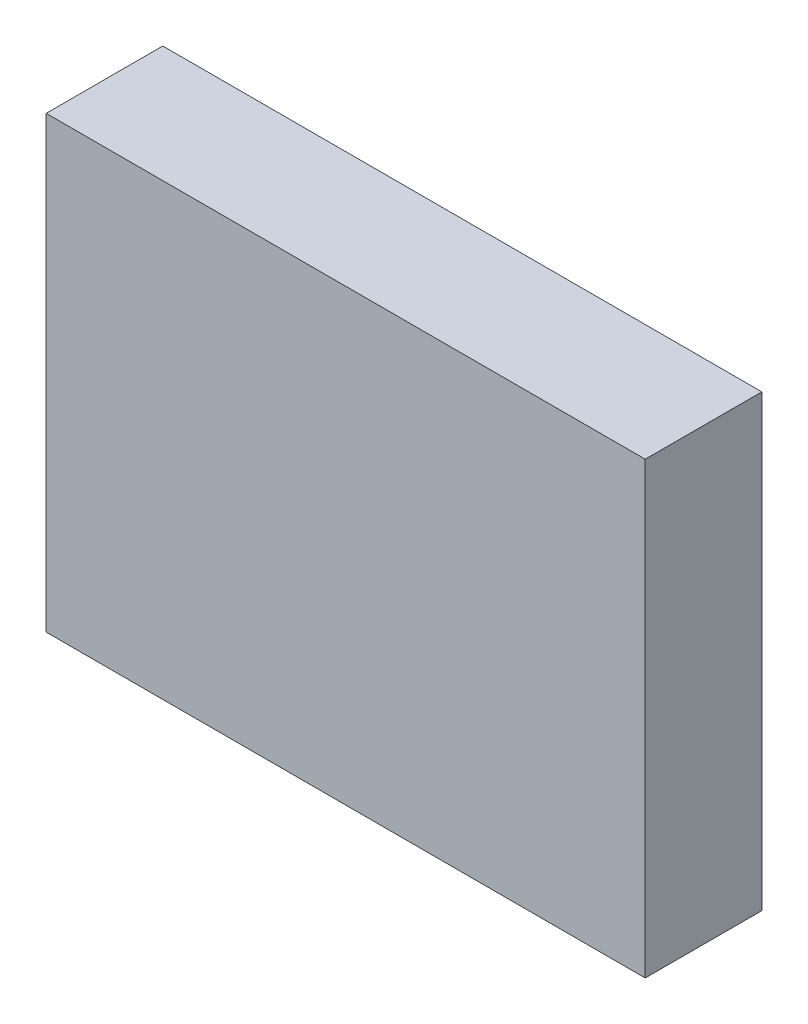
ISO-10303-21;
HEADER;
FILE_DESCRIPTION(('STEP AP214'),'2;1');
FILE_NAME('part.step','',(''),(''),'','','');
FILE_SCHEMA(('AUTOMOTIVE_DESIGN { 1 0 10303 214 1 1 1 1 }'));
ENDSEC;
DATA;
#1=APPLICATION_CONTEXT('core data for automotive mechanical design processes');
#2=APPLICATION_PROTOCOL_DEFINITION('international standard','automotive_design',2000,#1);
#3=PRODUCT_CONTEXT('',#1,'mechanical');
#4=PRODUCT('Part','Part','',(#3));
#5=PRODUCT_RELATED_PRODUCT_CATEGORY('part','',(#4));
#6=PRODUCT_DEFINITION_FORMATION('','',#4);
#7=PRODUCT_DEFINITION_CONTEXT('part definition',#1,'design');
#8=PRODUCT_DEFINITION('design','',#6,#7);
#9=PRODUCT_DEFINITION_SHAPE('','',#8);
#10=(LENGTH_UNIT() NAMED_UNIT(*) SI_UNIT(.MILLI.,.METRE.));
#11=(NAMED_UNIT(*) PLANE_ANGLE_UNIT() SI_UNIT($,.RADIAN.));
#12=(NAMED_UNIT(*) SI_UNIT($,.STERADIAN.) SOLID_ANGLE_UNIT());
#13=UNCERTAINTY_MEASURE_WITH_UNIT(LENGTH_MEASURE(1.E-05),#10,'distance_accuracy_value','');
#14=(GEOMETRIC_REPRESENTATION_CONTEXT(3) GLOBAL_UNCERTAINTY_ASSIGNED_CONTEXT((#13)) GLOBAL_UNIT_ASSIGNED_CONTEXT((#10,
#11,#12)) REPRESENTATION_CONTEXT('',''));
#15=CARTESIAN_POINT('',(0.,0.,0.));
#16=DIRECTION('',(0.,0.,1.));
#17=DIRECTION('',(1.,0.,0.));
#18=AXIS2_PLACEMENT_3D('',#15,#16,#17);
#19=CARTESIAN_POINT('',(-7.50000024,5.62500018,2.91999924));
#20=DIRECTION('',(0.,0.,1.));
#21=DIRECTION('',(1.,0.,0.));
#22=AXIS2_PLACEMENT_3D('',#19,#20,#21);
#23=PLANE('',#22);
#24=DIRECTION('',(0.,1.,0.));
#25=VECTOR('',#24,1.);
#26=CARTESIAN_POINT('',(7.50000024,5.62500018,2.91999924));
#27=LINE('',#26,#25);
#28=CARTESIAN_POINT('',(7.50000024,5.62500018,2.91999924));
#29=VERTEX_POINT('',#28);
#30=CARTESIAN_POINT('',(7.50000024,-5.62500018,2.91999924));
#31=VERTEX_POINT('',#30);
#32=EDGE_CURVE('E52',#29,#31,#27,.F.);
#33=ORIENTED_EDGE('',*,*,#32,.F.);
#34=DIRECTION('',(1.,0.,0.));
#35=VECTOR('',#34,1.);
#36=CARTESIAN_POINT('',(-7.50000024,5.62500018,2.91999924));
#37=LINE('',#36,#35);
#38=CARTESIAN_POINT('',(-7.50000024,5.62500018,2.91999924));
#39=VERTEX_POINT('',#38);
#40=EDGE_CURVE('E67',#39,#29,#37,.T.);
#41=ORIENTED_EDGE('',*,*,#40,.F.);
#42=DIRECTION('',(0.,1.,0.));
#43=VECTOR('',#42,1.);
#44=CARTESIAN_POINT('',(-7.50000024,-5.62500018,2.91999924));
#45=LINE('',#44,#43);
#46=CARTESIAN_POINT('',(-7.50000024,-5.62500018,2.91999924));
#47=VERTEX_POINT('',#46);
#48=EDGE_CURVE('E19',#47,#39,#45,.T.);
#49=ORIENTED_EDGE('',*,*,#48,.F.);
#50=DIRECTION('',(1.,0.,0.));
#51=VECTOR('',#50,1.);
#52=CARTESIAN_POINT('',(7.50000024,-5.62500018,2.91999924));
#53=LINE('',#52,#51);
#54=EDGE_CURVE('E57',#31,#47,#53,.F.);
#55=ORIENTED_EDGE('',*,*,#54,.F.);
#56=EDGE_LOOP('',(#33,#41,#49,#55));
#57=FACE_BOUND('',#56,.T.);
#58=ADVANCED_FACE('F16',(#57),#23,.T.);
#59=CARTESIAN_POINT('',(-7.50000024,-5.62500018,0.));
#60=DIRECTION('',(-1.,0.,0.));
#61=DIRECTION('',(0.,0.,1.));
#62=AXIS2_PLACEMENT_3D('',#59,#60,#61);
#63=PLANE('',#62);
#64=DIRECTION('',(0.,0.,1.));
#65=VECTOR('',#64,1.);
#66=CARTESIAN_POINT('',(-7.50000024,5.62500018,0.));
#67=LINE('',#66,#65);
#68=CARTESIAN_POINT('',(-7.50000024,5.62500018,0.));
#69=VERTEX_POINT('',#68);
#70=EDGE_CURVE('E78',#69,#39,#67,.T.);
#71=ORIENTED_EDGE('',*,*,#70,.F.);
#72=DIRECTION('',(0.,1.,0.));
#73=VECTOR('',#72,1.);
#74=CARTESIAN_POINT('',(-7.50000024,5.62500018,0.));
#75=LINE('',#74,#73);
#76=CARTESIAN_POINT('',(-7.50000024,-5.62500018,0.));
#77=VERTEX_POINT('',#76);
#78=EDGE_CURVE('E73',#69,#77,#75,.F.);
#79=ORIENTED_EDGE('',*,*,#78,.T.);
#80=DIRECTION('',(0.,0.,-1.));
#81=VECTOR('',#80,1.);
#82=CARTESIAN_POINT('',(-7.50000024,-5.62500018,0.));
#83=LINE('',#82,#81);
#84=EDGE_CURVE('E62',#47,#77,#83,.T.);
#85=ORIENTED_EDGE('',*,*,#84,.F.);
#86=ORIENTED_EDGE('',*,*,#48,.T.);
#87=EDGE_LOOP('',(#71,#79,#85,#86));
#88=FACE_BOUND('',#87,.T.);
#89=ADVANCED_FACE('F72',(#88),#63,.T.);
#90=CARTESIAN_POINT('',(7.50000024,-5.62500018,0.));
#91=DIRECTION('',(0.,-1.,0.));
#92=DIRECTION('',(0.,0.,-1.));
#93=AXIS2_PLACEMENT_3D('',#90,#91,#92);
#94=PLANE('',#93);
#95=ORIENTED_EDGE('',*,*,#84,.T.);
#96=DIRECTION('',(1.,0.,0.));
#97=VECTOR('',#96,1.);
#98=CARTESIAN_POINT('',(-7.50000024,-5.62500018,0.));
#99=LINE('',#98,#97);
#100=CARTESIAN_POINT('',(7.50000024,-5.62500018,0.));
#101=VERTEX_POINT('',#100);
#102=EDGE_CURVE('E83',#77,#101,#99,.T.);
#103=ORIENTED_EDGE('',*,*,#102,.T.);
#104=DIRECTION('',(0.,0.,-1.));
#105=VECTOR('',#104,1.);
#106=CARTESIAN_POINT('',(7.50000024,-5.62500018,0.));
#107=LINE('',#106,#105);
#108=EDGE_CURVE('E64',#31,#101,#107,.T.);
#109=ORIENTED_EDGE('',*,*,#108,.F.);
#110=ORIENTED_EDGE('',*,*,#54,.T.);
#111=EDGE_LOOP('',(#95,#103,#109,#110));
#112=FACE_BOUND('',#111,.T.);
#113=ADVANCED_FACE('F59',(#112),#94,.T.);
#114=CARTESIAN_POINT('',(7.50000024,5.62500018,0.));
#115=DIRECTION('',(1.,0.,0.));
#116=DIRECTION('',(0.,0.,-1.));
#117=AXIS2_PLACEMENT_3D('',#114,#115,#116);
#118=PLANE('',#117);
#119=ORIENTED_EDGE('',*,*,#108,.T.);
#120=DIRECTION('',(0.,1.,0.));
#121=VECTOR('',#120,1.);
#122=CARTESIAN_POINT('',(7.50000024,5.62500018,0.));
#123=LINE('',#122,#121);
#124=CARTESIAN_POINT('',(7.50000024,5.62500018,0.));
#125=VERTEX_POINT('',#124);
#126=EDGE_CURVE('E25',#101,#125,#123,.T.);
#127=ORIENTED_EDGE('',*,*,#126,.T.);
#128=DIRECTION('',(0.,0.,1.));
#129=VECTOR('',#128,1.);
#130=CARTESIAN_POINT('',(7.50000024,5.62500018,0.));
#131=LINE('',#130,#129);
#132=EDGE_CURVE('E33',#29,#125,#131,.F.);
#133=ORIENTED_EDGE('',*,*,#132,.F.);
#134=ORIENTED_EDGE('',*,*,#32,.T.);
#135=EDGE_LOOP('',(#119,#127,#133,#134));
#136=FACE_BOUND('',#135,.T.);
#137=ADVANCED_FACE('F87',(#136),#118,.T.);
#138=CARTESIAN_POINT('',(-7.50000024,5.62500018,0.));
#139=DIRECTION('',(0.,1.,0.));
#140=DIRECTION('',(0.,0.,1.));
#141=AXIS2_PLACEMENT_3D('',#138,#139,#140);
#142=PLANE('',#141);
#143=ORIENTED_EDGE('',*,*,#132,.T.);
#144=DIRECTION('',(1.,0.,0.));
#145=VECTOR('',#144,1.);
#146=CARTESIAN_POINT('',(-7.50000024,5.62500018,0.));
#147=LINE('',#146,#145);
#148=EDGE_CURVE('E11',#125,#69,#147,.F.);
#149=ORIENTED_EDGE('',*,*,#148,.T.);
#150=ORIENTED_EDGE('',*,*,#70,.T.);
#151=ORIENTED_EDGE('',*,*,#40,.T.);
#152=EDGE_LOOP('',(#143,#149,#150,#151));
#153=FACE_BOUND('',#152,.T.);
#154=ADVANCED_FACE('F90',(#153),#142,.T.);
#155=CARTESIAN_POINT('',(-7.50000024,5.62500018,0.));
#156=DIRECTION('',(0.,0.,1.));
#157=DIRECTION('',(1.,0.,0.));
#158=AXIS2_PLACEMENT_3D('',#155,#156,#157);
#159=PLANE('',#158);
#160=ORIENTED_EDGE('',*,*,#126,.F.);
#161=ORIENTED_EDGE('',*,*,#102,.F.);
#162=ORIENTED_EDGE('',*,*,#78,.F.);
#163=ORIENTED_EDGE('',*,*,#148,.F.);
#164=EDGE_LOOP('',(#160,#161,#162,#163));
#165=FACE_BOUND('',#164,.T.);
#166=ADVANCED_FACE('F89',(#165),#159,.F.);
#167=CLOSED_SHELL('',(#58,#89,#113,#137,#154,#166));
#168=MANIFOLD_SOLID_BREP('B1',#167);
#169=ADVANCED_BREP_SHAPE_REPRESENTATION('',(#18,#168),#14);
#170=SHAPE_DEFINITION_REPRESENTATION(#9,#169);
ENDSEC;
END-ISO-10303-21;
